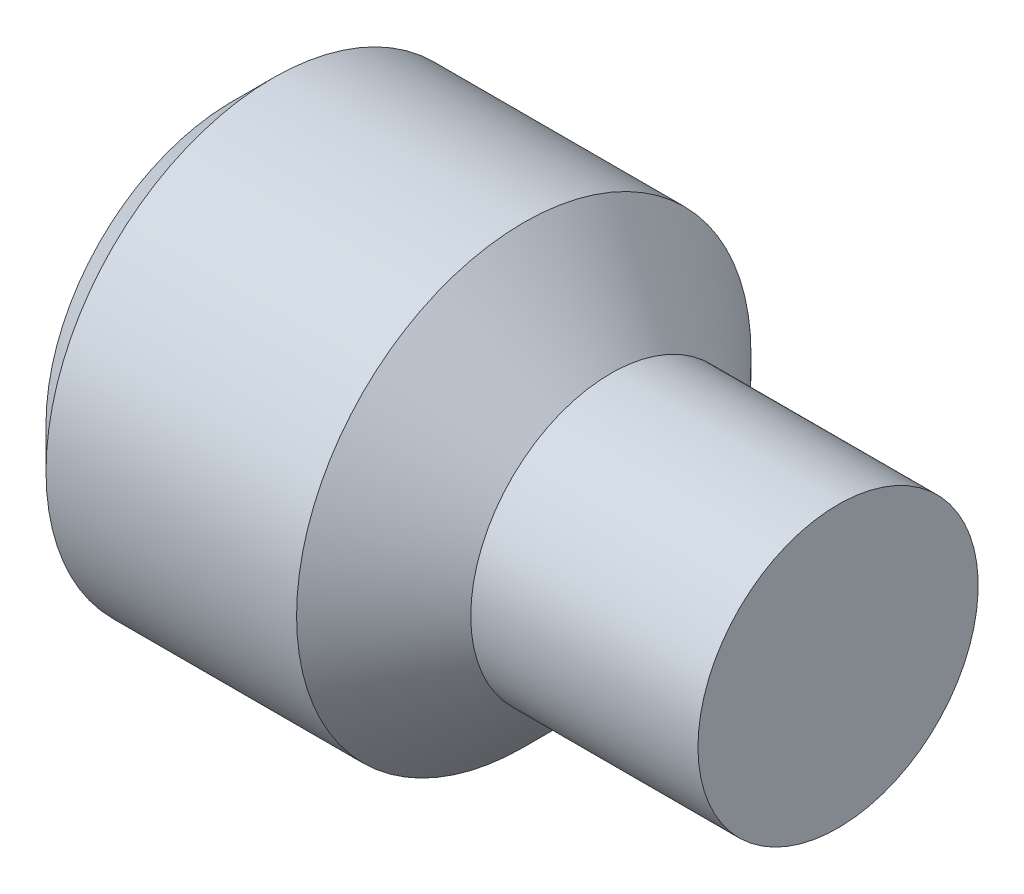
ISO-10303-21;
HEADER;
FILE_DESCRIPTION(('STEP AP214'),'2;1');
FILE_NAME('part.step','',(''),(''),'','','');
FILE_SCHEMA(('AUTOMOTIVE_DESIGN { 1 0 10303 214 1 1 1 1 }'));
ENDSEC;
DATA;
#1=APPLICATION_CONTEXT('core data for automotive mechanical design processes');
#2=APPLICATION_PROTOCOL_DEFINITION('international standard','automotive_design',2000,#1);
#3=PRODUCT_CONTEXT('',#1,'mechanical');
#4=PRODUCT('Part','Part','',(#3));
#5=PRODUCT_RELATED_PRODUCT_CATEGORY('part','',(#4));
#6=PRODUCT_DEFINITION_FORMATION('','',#4);
#7=PRODUCT_DEFINITION_CONTEXT('part definition',#1,'design');
#8=PRODUCT_DEFINITION('design','',#6,#7);
#9=PRODUCT_DEFINITION_SHAPE('','',#8);
#10=(LENGTH_UNIT() NAMED_UNIT(*) SI_UNIT(.MILLI.,.METRE.));
#11=(NAMED_UNIT(*) PLANE_ANGLE_UNIT() SI_UNIT($,.RADIAN.));
#12=(NAMED_UNIT(*) SI_UNIT($,.STERADIAN.) SOLID_ANGLE_UNIT());
#13=UNCERTAINTY_MEASURE_WITH_UNIT(LENGTH_MEASURE(1.E-05),#10,'distance_accuracy_value','');
#14=(GEOMETRIC_REPRESENTATION_CONTEXT(3) GLOBAL_UNCERTAINTY_ASSIGNED_CONTEXT((#13)) GLOBAL_UNIT_ASSIGNED_CONTEXT((#10,
#11,#12)) REPRESENTATION_CONTEXT('',''));
#15=CARTESIAN_POINT('',(0.,0.,0.));
#16=DIRECTION('',(0.,0.,1.));
#17=DIRECTION('',(1.,0.,0.));
#18=AXIS2_PLACEMENT_3D('',#15,#16,#17);
#19=CARTESIAN_POINT('',(1.99999999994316,-3.02,0.));
#20=DIRECTION('',(1.,0.,0.));
#21=DIRECTION('',(0.,0.,-1.));
#22=AXIS2_PLACEMENT_3D('',#19,#20,#21);
#23=PLANE('',#22);
#24=CARTESIAN_POINT('',(1.99999999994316,0.,0.));
#25=DIRECTION('',(-1.,0.,0.));
#26=DIRECTION('',(0.,0.,1.));
#27=AXIS2_PLACEMENT_3D('',#24,#25,#26);
#28=CIRCLE('',#27,1.51);
#29=CARTESIAN_POINT('',(1.99999999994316,0.755000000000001,1.3076983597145));
#30=VERTEX_POINT('',#29);
#31=CARTESIAN_POINT('',(1.99999999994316,1.51,0.));
#32=VERTEX_POINT('',#31);
#33=EDGE_CURVE('E48',#30,#32,#28,.T.);
#34=ORIENTED_EDGE('',*,*,#33,.F.);
#35=DIRECTION('',(0.,0.866025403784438,-0.5));
#36=VECTOR('',#35,1.);
#37=CARTESIAN_POINT('',(1.99999999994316,0.,1.74359781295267));
#38=LINE('',#37,#36);
#39=CARTESIAN_POINT('',(1.99999999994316,1.51,0.871798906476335));
#40=VERTEX_POINT('',#39);
#41=EDGE_CURVE('E161',#30,#40,#38,.T.);
#42=ORIENTED_EDGE('',*,*,#41,.T.);
#43=DIRECTION('',(0.,0.,-1.));
#44=VECTOR('',#43,1.);
#45=CARTESIAN_POINT('',(1.99999999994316,1.51,0.871798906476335));
#46=LINE('',#45,#44);
#47=EDGE_CURVE('E165',#40,#32,#46,.T.);
#48=ORIENTED_EDGE('',*,*,#47,.T.);
#49=EDGE_LOOP('',(#34,#42,#48));
#50=FACE_BOUND('',#49,.T.);
#51=ADVANCED_FACE('F37',(#50),#23,.F.);
#52=CARTESIAN_POINT('',(1.99999999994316,0.755,-1.3076983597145));
#53=VERTEX_POINT('',#52);
#54=EDGE_CURVE('E11',#32,#53,#28,.T.);
#55=ORIENTED_EDGE('',*,*,#54,.F.);
#56=CARTESIAN_POINT('',(1.99999999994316,1.51,-0.871798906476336));
#57=VERTEX_POINT('',#56);
#58=EDGE_CURVE('E164',#32,#57,#46,.T.);
#59=ORIENTED_EDGE('',*,*,#58,.T.);
#60=DIRECTION('',(0.,-0.866025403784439,-0.5));
#61=VECTOR('',#60,1.);
#62=CARTESIAN_POINT('',(1.99999999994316,1.51,-0.871798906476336));
#63=LINE('',#62,#61);
#64=EDGE_CURVE('E169',#57,#53,#63,.T.);
#65=ORIENTED_EDGE('',*,*,#64,.T.);
#66=EDGE_LOOP('',(#55,#59,#65));
#67=FACE_BOUND('',#66,.T.);
#68=ADVANCED_FACE('F124',(#67),#23,.F.);
#69=CARTESIAN_POINT('',(1.99999999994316,-0.755000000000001,-1.3076983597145));
#70=VERTEX_POINT('',#69);
#71=EDGE_CURVE('E46',#53,#70,#28,.T.);
#72=ORIENTED_EDGE('',*,*,#71,.F.);
#73=CARTESIAN_POINT('',(1.99999999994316,0.,-1.74359781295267));
#74=VERTEX_POINT('',#73);
#75=EDGE_CURVE('E168',#53,#74,#63,.T.);
#76=ORIENTED_EDGE('',*,*,#75,.T.);
#77=DIRECTION('',(0.,-0.866025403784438,0.5));
#78=VECTOR('',#77,1.);
#79=CARTESIAN_POINT('',(1.99999999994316,0.,-1.74359781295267));
#80=LINE('',#79,#78);
#81=EDGE_CURVE('E173',#74,#70,#80,.T.);
#82=ORIENTED_EDGE('',*,*,#81,.T.);
#83=EDGE_LOOP('',(#72,#76,#82));
#84=FACE_BOUND('',#83,.T.);
#85=ADVANCED_FACE('F130',(#84),#23,.F.);
#86=CARTESIAN_POINT('',(1.99999999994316,-1.51,0.));
#87=VERTEX_POINT('',#86);
#88=EDGE_CURVE('E281',#70,#87,#28,.T.);
#89=ORIENTED_EDGE('',*,*,#88,.F.);
#90=CARTESIAN_POINT('',(1.99999999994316,-1.51,-0.871798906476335));
#91=VERTEX_POINT('',#90);
#92=EDGE_CURVE('E172',#70,#91,#80,.T.);
#93=ORIENTED_EDGE('',*,*,#92,.T.);
#94=DIRECTION('',(0.,0.,1.));
#95=VECTOR('',#94,1.);
#96=CARTESIAN_POINT('',(1.99999999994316,-1.51,-0.871798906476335));
#97=LINE('',#96,#95);
#98=EDGE_CURVE('E176',#91,#87,#97,.T.);
#99=ORIENTED_EDGE('',*,*,#98,.T.);
#100=EDGE_LOOP('',(#89,#93,#99));
#101=FACE_BOUND('',#100,.T.);
#102=ADVANCED_FACE('F143',(#101),#23,.F.);
#103=CARTESIAN_POINT('',(1.99999999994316,-0.755000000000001,1.3076983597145));
#104=VERTEX_POINT('',#103);
#105=EDGE_CURVE('E55',#87,#104,#28,.T.);
#106=ORIENTED_EDGE('',*,*,#105,.F.);
#107=CARTESIAN_POINT('',(1.99999999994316,-1.51,0.871798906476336));
#108=VERTEX_POINT('',#107);
#109=EDGE_CURVE('E159',#87,#108,#97,.T.);
#110=ORIENTED_EDGE('',*,*,#109,.T.);
#111=DIRECTION('',(0.,0.866025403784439,0.5));
#112=VECTOR('',#111,1.);
#113=CARTESIAN_POINT('',(1.99999999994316,-1.51,0.871798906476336));
#114=LINE('',#113,#112);
#115=EDGE_CURVE('E154',#108,#104,#114,.T.);
#116=ORIENTED_EDGE('',*,*,#115,.T.);
#117=EDGE_LOOP('',(#106,#110,#116));
#118=FACE_BOUND('',#117,.T.);
#119=ADVANCED_FACE('F135',(#118),#23,.F.);
#120=EDGE_CURVE('E146',#104,#30,#28,.T.);
#121=ORIENTED_EDGE('',*,*,#120,.F.);
#122=CARTESIAN_POINT('',(1.99999999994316,0.,1.74359781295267));
#123=VERTEX_POINT('',#122);
#124=EDGE_CURVE('E148',#104,#123,#114,.T.);
#125=ORIENTED_EDGE('',*,*,#124,.T.);
#126=EDGE_CURVE('E150',#123,#30,#38,.T.);
#127=ORIENTED_EDGE('',*,*,#126,.T.);
#128=EDGE_LOOP('',(#121,#125,#127));
#129=FACE_BOUND('',#128,.T.);
#130=ADVANCED_FACE('F126',(#129),#23,.F.);
#131=CARTESIAN_POINT('',(0.,2.4585,0.));
#132=DIRECTION('',(1.,0.,0.));
#133=DIRECTION('',(0.,0.,-1.));
#134=AXIS2_PLACEMENT_3D('',#131,#132,#133);
#135=PLANE('',#134);
#136=DIRECTION('',(0.,0.866025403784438,-0.5));
#137=VECTOR('',#136,1.);
#138=CARTESIAN_POINT('',(-5.6843418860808E-11,0.,1.74359781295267));
#139=LINE('',#138,#137);
#140=CARTESIAN_POINT('',(0.,0.,1.74359781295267));
#141=VERTEX_POINT('',#140);
#142=CARTESIAN_POINT('',(-5.6843418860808E-11,1.51,0.871798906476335));
#143=VERTEX_POINT('',#142);
#144=EDGE_CURVE('E180',#141,#143,#139,.T.);
#145=ORIENTED_EDGE('',*,*,#144,.F.);
#146=DIRECTION('',(0.,0.866025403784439,0.5));
#147=VECTOR('',#146,1.);
#148=CARTESIAN_POINT('',(-5.6843418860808E-11,-1.51,0.871798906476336));
#149=LINE('',#148,#147);
#150=CARTESIAN_POINT('',(-5.6843418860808E-11,-1.51,0.871798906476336));
#151=VERTEX_POINT('',#150);
#152=EDGE_CURVE('E63',#151,#141,#149,.T.);
#153=ORIENTED_EDGE('',*,*,#152,.F.);
#154=DIRECTION('',(0.,0.,1.));
#155=VECTOR('',#154,1.);
#156=CARTESIAN_POINT('',(-5.6843418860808E-11,-1.51,-0.871798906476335));
#157=LINE('',#156,#155);
#158=CARTESIAN_POINT('',(-5.6843418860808E-11,-1.51,-0.871798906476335));
#159=VERTEX_POINT('',#158);
#160=EDGE_CURVE('E156',#159,#151,#157,.T.);
#161=ORIENTED_EDGE('',*,*,#160,.F.);
#162=DIRECTION('',(0.,-0.866025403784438,0.5));
#163=VECTOR('',#162,1.);
#164=CARTESIAN_POINT('',(-5.6843418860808E-11,0.,-1.74359781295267));
#165=LINE('',#164,#163);
#166=CARTESIAN_POINT('',(-5.6843418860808E-11,0.,-1.74359781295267));
#167=VERTEX_POINT('',#166);
#168=EDGE_CURVE('E189',#167,#159,#165,.T.);
#169=ORIENTED_EDGE('',*,*,#168,.F.);
#170=DIRECTION('',(0.,-0.866025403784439,-0.5));
#171=VECTOR('',#170,1.);
#172=CARTESIAN_POINT('',(-5.6843418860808E-11,1.51,-0.871798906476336));
#173=LINE('',#172,#171);
#174=CARTESIAN_POINT('',(-5.6843418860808E-11,1.51,-0.871798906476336));
#175=VERTEX_POINT('',#174);
#176=EDGE_CURVE('E186',#175,#167,#173,.T.);
#177=ORIENTED_EDGE('',*,*,#176,.F.);
#178=DIRECTION('',(0.,0.,-1.));
#179=VECTOR('',#178,1.);
#180=CARTESIAN_POINT('',(-5.6843418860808E-11,1.51,0.871798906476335));
#181=LINE('',#180,#179);
#182=EDGE_CURVE('E183',#143,#175,#181,.T.);
#183=ORIENTED_EDGE('',*,*,#182,.F.);
#184=EDGE_LOOP('',(#145,#153,#161,#169,#177,#183));
#185=FACE_BOUND('',#184,.T.);
#186=CARTESIAN_POINT('',(0.,0.,0.));
#187=DIRECTION('',(-1.,0.,0.));
#188=DIRECTION('',(0.,0.,1.));
#189=AXIS2_PLACEMENT_3D('',#186,#187,#188);
#190=CIRCLE('',#189,2.4585);
#191=CARTESIAN_POINT('',(0.,0.,2.4585));
#192=VERTEX_POINT('',#191);
#193=EDGE_CURVE('E41',#192,#192,#190,.T.);
#194=ORIENTED_EDGE('',*,*,#193,.T.);
#195=EDGE_LOOP('',(#194));
#196=FACE_BOUND('',#195,.T.);
#197=ADVANCED_FACE('F39',(#185,#196),#135,.F.);
#198=CARTESIAN_POINT('',(0.541500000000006,0.,0.));
#199=DIRECTION('',(1.,0.,0.));
#200=DIRECTION('',(0.,0.,-1.));
#201=AXIS2_PLACEMENT_3D('',#198,#199,#200);
#202=CONICAL_SURFACE('',#201,3.,0.785398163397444);
#203=ORIENTED_EDGE('',*,*,#193,.F.);
#204=EDGE_LOOP('',(#203));
#205=FACE_BOUND('',#204,.T.);
#206=CARTESIAN_POINT('',(0.541500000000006,0.,0.));
#207=DIRECTION('',(-1.,0.,0.));
#208=DIRECTION('',(0.,0.,1.));
#209=AXIS2_PLACEMENT_3D('',#206,#207,#208);
#210=CIRCLE('',#209,3.);
#211=CARTESIAN_POINT('',(0.541500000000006,0.,3.));
#212=VERTEX_POINT('',#211);
#213=EDGE_CURVE('E213',#212,#212,#210,.T.);
#214=ORIENTED_EDGE('',*,*,#213,.T.);
#215=EDGE_LOOP('',(#214));
#216=FACE_BOUND('',#215,.T.);
#217=ADVANCED_FACE('F141',(#205,#216),#202,.T.);
#218=CARTESIAN_POINT('',(-1.96882056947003,0.,0.));
#219=DIRECTION('',(-1.,0.,0.));
#220=DIRECTION('',(0.,0.,1.));
#221=AXIS2_PLACEMENT_3D('',#218,#219,#220);
#222=CYLINDRICAL_SURFACE('',#221,3.);
#223=ORIENTED_EDGE('',*,*,#213,.F.);
#224=EDGE_LOOP('',(#223));
#225=FACE_BOUND('',#224,.T.);
#226=CARTESIAN_POINT('',(3.85000000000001,0.,0.));
#227=DIRECTION('',(-1.,0.,0.));
#228=DIRECTION('',(0.,0.,1.));
#229=AXIS2_PLACEMENT_3D('',#226,#227,#228);
#230=CIRCLE('',#229,3.);
#231=CARTESIAN_POINT('',(3.85000000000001,0.,3.));
#232=VERTEX_POINT('',#231);
#233=EDGE_CURVE('E211',#232,#232,#230,.T.);
#234=ORIENTED_EDGE('',*,*,#233,.T.);
#235=EDGE_LOOP('',(#234));
#236=FACE_BOUND('',#235,.T.);
#237=ADVANCED_FACE('F225',(#225,#236),#222,.T.);
#238=CARTESIAN_POINT('',(5.,0.,0.));
#239=DIRECTION('',(-1.,0.,0.));
#240=DIRECTION('',(0.,0.,1.));
#241=AXIS2_PLACEMENT_3D('',#238,#239,#240);
#242=CONICAL_SURFACE('',#241,1.85,0.78539816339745);
#243=ORIENTED_EDGE('',*,*,#233,.F.);
#244=EDGE_LOOP('',(#243));
#245=FACE_BOUND('',#244,.T.);
#246=CARTESIAN_POINT('',(5.,0.,0.));
#247=DIRECTION('',(-1.,0.,0.));
#248=DIRECTION('',(0.,0.,1.));
#249=AXIS2_PLACEMENT_3D('',#246,#247,#248);
#250=CIRCLE('',#249,1.85);
#251=CARTESIAN_POINT('',(5.,0.,1.85));
#252=VERTEX_POINT('',#251);
#253=EDGE_CURVE('E208',#252,#252,#250,.T.);
#254=ORIENTED_EDGE('',*,*,#253,.T.);
#255=EDGE_LOOP('',(#254));
#256=FACE_BOUND('',#255,.T.);
#257=ADVANCED_FACE('F229',(#245,#256),#242,.T.);
#258=CARTESIAN_POINT('',(-1.96882056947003,0.,0.));
#259=DIRECTION('',(-1.,0.,0.));
#260=DIRECTION('',(0.,0.,1.));
#261=AXIS2_PLACEMENT_3D('',#258,#259,#260);
#262=CYLINDRICAL_SURFACE('',#261,1.85);
#263=ORIENTED_EDGE('',*,*,#253,.F.);
#264=EDGE_LOOP('',(#263));
#265=FACE_BOUND('',#264,.T.);
#266=CARTESIAN_POINT('',(8.,0.,0.));
#267=DIRECTION('',(-1.,0.,0.));
#268=DIRECTION('',(0.,0.,1.));
#269=AXIS2_PLACEMENT_3D('',#266,#267,#268);
#270=CIRCLE('',#269,1.85);
#271=CARTESIAN_POINT('',(8.,0.,1.85));
#272=VERTEX_POINT('',#271);
#273=EDGE_CURVE('E196',#272,#272,#270,.T.);
#274=ORIENTED_EDGE('',*,*,#273,.T.);
#275=EDGE_LOOP('',(#274));
#276=FACE_BOUND('',#275,.T.);
#277=ADVANCED_FACE('F235',(#265,#276),#262,.T.);
#278=CARTESIAN_POINT('',(8.,0.,0.));
#279=DIRECTION('',(-1.,0.,0.));
#280=DIRECTION('',(0.,0.,1.));
#281=AXIS2_PLACEMENT_3D('',#278,#279,#280);
#282=PLANE('',#281);
#283=ORIENTED_EDGE('',*,*,#273,.F.);
#284=EDGE_LOOP('',(#283));
#285=FACE_BOUND('',#284,.T.);
#286=ADVANCED_FACE('F239',(#285),#282,.F.);
#287=CARTESIAN_POINT('',(1.99999999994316,-1.51,0.871798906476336));
#288=DIRECTION('',(0.,-0.5,0.866025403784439));
#289=DIRECTION('',(0.,-0.866025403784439,-0.5));
#290=AXIS2_PLACEMENT_3D('',#287,#288,#289);
#291=PLANE('',#290);
#292=ORIENTED_EDGE('',*,*,#152,.T.);
#293=DIRECTION('',(-1.,0.,0.));
#294=VECTOR('',#293,1.);
#295=CARTESIAN_POINT('',(1.99999999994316,0.,1.74359781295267));
#296=LINE('',#295,#294);
#297=EDGE_CURVE('E155',#123,#141,#296,.T.);
#298=ORIENTED_EDGE('',*,*,#297,.F.);
#299=ORIENTED_EDGE('',*,*,#124,.F.);
#300=ORIENTED_EDGE('',*,*,#115,.F.);
#301=DIRECTION('',(-1.,0.,0.));
#302=VECTOR('',#301,1.);
#303=CARTESIAN_POINT('',(1.99999999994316,-1.51,0.871798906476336));
#304=LINE('',#303,#302);
#305=EDGE_CURVE('E194',#108,#151,#304,.T.);
#306=ORIENTED_EDGE('',*,*,#305,.T.);
#307=EDGE_LOOP('',(#292,#298,#299,#300,#306));
#308=FACE_BOUND('',#307,.T.);
#309=ADVANCED_FACE('F153',(#308),#291,.F.);
#310=CARTESIAN_POINT('',(1.99999999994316,-1.51,-0.871798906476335));
#311=DIRECTION('',(0.,-1.,0.));
#312=DIRECTION('',(0.,0.,-1.));
#313=AXIS2_PLACEMENT_3D('',#310,#311,#312);
#314=PLANE('',#313);
#315=ORIENTED_EDGE('',*,*,#160,.T.);
#316=ORIENTED_EDGE('',*,*,#305,.F.);
#317=ORIENTED_EDGE('',*,*,#109,.F.);
#318=ORIENTED_EDGE('',*,*,#98,.F.);
#319=DIRECTION('',(-1.,0.,0.));
#320=VECTOR('',#319,1.);
#321=CARTESIAN_POINT('',(1.99999999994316,-1.51,-0.871798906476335));
#322=LINE('',#321,#320);
#323=EDGE_CURVE('E197',#91,#159,#322,.T.);
#324=ORIENTED_EDGE('',*,*,#323,.T.);
#325=EDGE_LOOP('',(#315,#316,#317,#318,#324));
#326=FACE_BOUND('',#325,.T.);
#327=ADVANCED_FACE('F245',(#326),#314,.F.);
#328=CARTESIAN_POINT('',(1.99999999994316,0.,-1.74359781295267));
#329=DIRECTION('',(0.,-0.5,-0.866025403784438));
#330=DIRECTION('',(0.,0.866025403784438,-0.5));
#331=AXIS2_PLACEMENT_3D('',#328,#329,#330);
#332=PLANE('',#331);
#333=ORIENTED_EDGE('',*,*,#168,.T.);
#334=ORIENTED_EDGE('',*,*,#323,.F.);
#335=ORIENTED_EDGE('',*,*,#92,.F.);
#336=ORIENTED_EDGE('',*,*,#81,.F.);
#337=DIRECTION('',(-1.,0.,0.));
#338=VECTOR('',#337,1.);
#339=CARTESIAN_POINT('',(1.99999999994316,0.,-1.74359781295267));
#340=LINE('',#339,#338);
#341=EDGE_CURVE('E199',#74,#167,#340,.T.);
#342=ORIENTED_EDGE('',*,*,#341,.T.);
#343=EDGE_LOOP('',(#333,#334,#335,#336,#342));
#344=FACE_BOUND('',#343,.T.);
#345=ADVANCED_FACE('F253',(#344),#332,.F.);
#346=CARTESIAN_POINT('',(1.99999999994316,1.51,-0.871798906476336));
#347=DIRECTION('',(0.,0.5,-0.866025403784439));
#348=DIRECTION('',(0.,0.866025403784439,0.5));
#349=AXIS2_PLACEMENT_3D('',#346,#347,#348);
#350=PLANE('',#349);
#351=ORIENTED_EDGE('',*,*,#176,.T.);
#352=ORIENTED_EDGE('',*,*,#341,.F.);
#353=ORIENTED_EDGE('',*,*,#75,.F.);
#354=ORIENTED_EDGE('',*,*,#64,.F.);
#355=DIRECTION('',(-1.,0.,0.));
#356=VECTOR('',#355,1.);
#357=CARTESIAN_POINT('',(1.99999999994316,1.51,-0.871798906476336));
#358=LINE('',#357,#356);
#359=EDGE_CURVE('E201',#57,#175,#358,.T.);
#360=ORIENTED_EDGE('',*,*,#359,.T.);
#361=EDGE_LOOP('',(#351,#352,#353,#354,#360));
#362=FACE_BOUND('',#361,.T.);
#363=ADVANCED_FACE('F249',(#362),#350,.F.);
#364=CARTESIAN_POINT('',(1.99999999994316,1.51,0.871798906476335));
#365=DIRECTION('',(0.,1.,0.));
#366=DIRECTION('',(0.,0.,1.));
#367=AXIS2_PLACEMENT_3D('',#364,#365,#366);
#368=PLANE('',#367);
#369=ORIENTED_EDGE('',*,*,#182,.T.);
#370=ORIENTED_EDGE('',*,*,#359,.F.);
#371=ORIENTED_EDGE('',*,*,#58,.F.);
#372=ORIENTED_EDGE('',*,*,#47,.F.);
#373=DIRECTION('',(-1.,0.,0.));
#374=VECTOR('',#373,1.);
#375=CARTESIAN_POINT('',(1.99999999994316,1.51,0.871798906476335));
#376=LINE('',#375,#374);
#377=EDGE_CURVE('E203',#40,#143,#376,.T.);
#378=ORIENTED_EDGE('',*,*,#377,.T.);
#379=EDGE_LOOP('',(#369,#370,#371,#372,#378));
#380=FACE_BOUND('',#379,.T.);
#381=ADVANCED_FACE('F119',(#380),#368,.F.);
#382=CARTESIAN_POINT('',(1.99999999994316,0.,1.74359781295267));
#383=DIRECTION('',(0.,0.5,0.866025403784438));
#384=DIRECTION('',(0.,-0.866025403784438,0.5));
#385=AXIS2_PLACEMENT_3D('',#382,#383,#384);
#386=PLANE('',#385);
#387=ORIENTED_EDGE('',*,*,#144,.T.);
#388=ORIENTED_EDGE('',*,*,#377,.F.);
#389=ORIENTED_EDGE('',*,*,#41,.F.);
#390=ORIENTED_EDGE('',*,*,#126,.F.);
#391=ORIENTED_EDGE('',*,*,#297,.T.);
#392=EDGE_LOOP('',(#387,#388,#389,#390,#391));
#393=FACE_BOUND('',#392,.T.);
#394=ADVANCED_FACE('F114',(#393),#386,.F.);
#395=CARTESIAN_POINT('',(2.39999999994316,0.,0.));
#396=DIRECTION('',(-1.,0.,0.));
#397=DIRECTION('',(0.,0.,1.));
#398=AXIS2_PLACEMENT_3D('',#395,#396,#397);
#399=CONICAL_SURFACE('',#398,0.,1.31184341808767);
#400=ORIENTED_EDGE('',*,*,#33,.T.);
#401=ORIENTED_EDGE('',*,*,#54,.T.);
#402=ORIENTED_EDGE('',*,*,#71,.T.);
#403=ORIENTED_EDGE('',*,*,#88,.T.);
#404=ORIENTED_EDGE('',*,*,#105,.T.);
#405=ORIENTED_EDGE('',*,*,#120,.T.);
#406=EDGE_LOOP('',(#400,#401,#402,#403,#404,#405));
#407=FACE_BOUND('',#406,.T.);
#408=CARTESIAN_POINT('',(2.39999999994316,0.,0.));
#409=VERTEX_POINT('',#408);
#410=VERTEX_LOOP('',#409);
#411=FACE_BOUND('',#410,.T.);
#412=ADVANCED_FACE('F112',(#407,#411),#399,.F.);
#413=CLOSED_SHELL('',(#51,#68,#85,#102,#119,#130,#197,#217,#237,#257,#277,#286,#309,#327,#345,
#363,#381,#394,#412));
#414=MANIFOLD_SOLID_BREP('B2',#413);
#415=ADVANCED_BREP_SHAPE_REPRESENTATION('',(#18,#414),#14);
#416=SHAPE_DEFINITION_REPRESENTATION(#9,#415);
ENDSEC;
END-ISO-10303-21;
